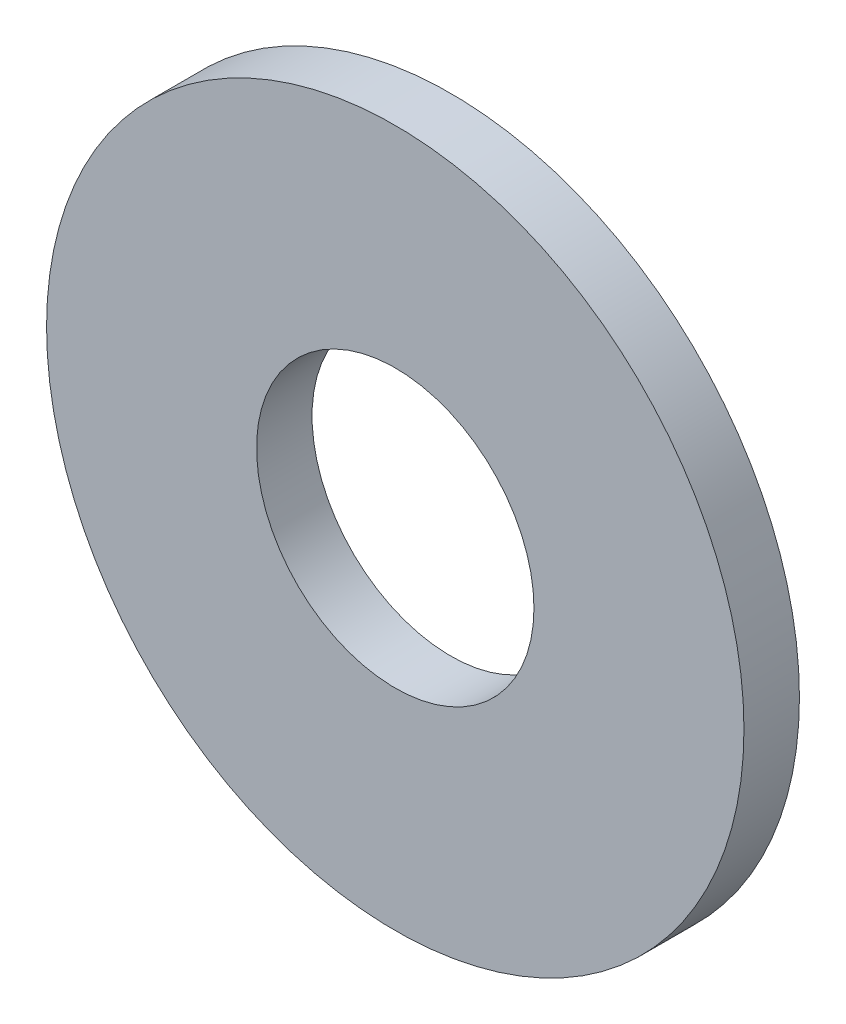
ISO-10303-21;
HEADER;
FILE_DESCRIPTION(('STEP AP214'),'2;1');
FILE_NAME('part.step','',(''),(''),'','','');
FILE_SCHEMA(('AUTOMOTIVE_DESIGN { 1 0 10303 214 1 1 1 1 }'));
ENDSEC;
DATA;
#1=APPLICATION_CONTEXT('core data for automotive mechanical design processes');
#2=APPLICATION_PROTOCOL_DEFINITION('international standard','automotive_design',2000,#1);
#3=PRODUCT_CONTEXT('',#1,'mechanical');
#4=PRODUCT('Part','Part','',(#3));
#5=PRODUCT_RELATED_PRODUCT_CATEGORY('part','',(#4));
#6=PRODUCT_DEFINITION_FORMATION('','',#4);
#7=PRODUCT_DEFINITION_CONTEXT('part definition',#1,'design');
#8=PRODUCT_DEFINITION('design','',#6,#7);
#9=PRODUCT_DEFINITION_SHAPE('','',#8);
#10=(LENGTH_UNIT() NAMED_UNIT(*) SI_UNIT(.MILLI.,.METRE.));
#11=(NAMED_UNIT(*) PLANE_ANGLE_UNIT() SI_UNIT($,.RADIAN.));
#12=(NAMED_UNIT(*) SI_UNIT($,.STERADIAN.) SOLID_ANGLE_UNIT());
#13=UNCERTAINTY_MEASURE_WITH_UNIT(LENGTH_MEASURE(1.E-05),#10,'distance_accuracy_value','');
#14=(GEOMETRIC_REPRESENTATION_CONTEXT(3) GLOBAL_UNCERTAINTY_ASSIGNED_CONTEXT((#13)) GLOBAL_UNIT_ASSIGNED_CONTEXT((#10,
#11,#12)) REPRESENTATION_CONTEXT('',''));
#15=CARTESIAN_POINT('',(0.,0.,0.));
#16=DIRECTION('',(0.,0.,1.));
#17=DIRECTION('',(1.,0.,0.));
#18=AXIS2_PLACEMENT_3D('',#15,#16,#17);
#19=CARTESIAN_POINT('',(0.,0.,0.7));
#20=DIRECTION('',(0.,0.,1.));
#21=DIRECTION('',(1.,0.,0.));
#22=AXIS2_PLACEMENT_3D('',#19,#20,#21);
#23=PLANE('',#22);
#24=CARTESIAN_POINT('',(0.,0.,0.7));
#25=DIRECTION('',(0.,0.,1.));
#26=DIRECTION('',(1.,0.,0.));
#27=AXIS2_PLACEMENT_3D('',#24,#25,#26);
#28=CIRCLE('',#27,4.4);
#29=CARTESIAN_POINT('',(4.4,0.,0.7));
#30=VERTEX_POINT('',#29);
#31=EDGE_CURVE('E10',#30,#30,#28,.T.);
#32=ORIENTED_EDGE('',*,*,#31,.T.);
#33=EDGE_LOOP('',(#32));
#34=FACE_BOUND('',#33,.T.);
#35=CARTESIAN_POINT('',(0.,0.,0.7));
#36=DIRECTION('',(0.,0.,1.));
#37=DIRECTION('',(1.,0.,0.));
#38=AXIS2_PLACEMENT_3D('',#35,#36,#37);
#39=CIRCLE('',#38,1.75);
#40=CARTESIAN_POINT('',(1.75,0.,0.7));
#41=VERTEX_POINT('',#40);
#42=EDGE_CURVE('E359',#41,#41,#39,.T.);
#43=ORIENTED_EDGE('',*,*,#42,.F.);
#44=EDGE_LOOP('',(#43));
#45=FACE_BOUND('',#44,.T.);
#46=ADVANCED_FACE('F348',(#34,#45),#23,.T.);
#47=CARTESIAN_POINT('',(0.,0.,0.));
#48=DIRECTION('',(0.,0.,1.));
#49=DIRECTION('',(1.,0.,0.));
#50=AXIS2_PLACEMENT_3D('',#47,#48,#49);
#51=PLANE('',#50);
#52=CARTESIAN_POINT('',(0.,0.,0.));
#53=DIRECTION('',(0.,0.,1.));
#54=DIRECTION('',(1.,0.,0.));
#55=AXIS2_PLACEMENT_3D('',#52,#53,#54);
#56=CIRCLE('',#55,4.4);
#57=CARTESIAN_POINT('',(4.4,0.,0.));
#58=VERTEX_POINT('',#57);
#59=EDGE_CURVE('E355',#58,#58,#56,.T.);
#60=ORIENTED_EDGE('',*,*,#59,.F.);
#61=EDGE_LOOP('',(#60));
#62=FACE_BOUND('',#61,.T.);
#63=CARTESIAN_POINT('',(0.,0.,0.));
#64=DIRECTION('',(0.,0.,1.));
#65=DIRECTION('',(1.,0.,0.));
#66=AXIS2_PLACEMENT_3D('',#63,#64,#65);
#67=CIRCLE('',#66,1.75);
#68=CARTESIAN_POINT('',(1.75,0.,0.));
#69=VERTEX_POINT('',#68);
#70=EDGE_CURVE('E363',#69,#69,#67,.T.);
#71=ORIENTED_EDGE('',*,*,#70,.T.);
#72=EDGE_LOOP('',(#71));
#73=FACE_BOUND('',#72,.T.);
#74=ADVANCED_FACE('F369',(#62,#73),#51,.F.);
#75=CARTESIAN_POINT('',(0.,0.,0.7));
#76=DIRECTION('',(0.,0.,-1.));
#77=DIRECTION('',(-1.,0.,0.));
#78=AXIS2_PLACEMENT_3D('',#75,#76,#77);
#79=CYLINDRICAL_SURFACE('',#78,4.4);
#80=ORIENTED_EDGE('',*,*,#31,.F.);
#81=EDGE_LOOP('',(#80));
#82=FACE_BOUND('',#81,.T.);
#83=ORIENTED_EDGE('',*,*,#59,.T.);
#84=EDGE_LOOP('',(#83));
#85=FACE_BOUND('',#84,.T.);
#86=ADVANCED_FACE('F350',(#82,#85),#79,.T.);
#87=CARTESIAN_POINT('',(0.,0.,0.7));
#88=DIRECTION('',(0.,0.,-1.));
#89=DIRECTION('',(-1.,0.,0.));
#90=AXIS2_PLACEMENT_3D('',#87,#88,#89);
#91=CYLINDRICAL_SURFACE('',#90,1.75);
#92=ORIENTED_EDGE('',*,*,#42,.T.);
#93=EDGE_LOOP('',(#92));
#94=FACE_BOUND('',#93,.T.);
#95=ORIENTED_EDGE('',*,*,#70,.F.);
#96=EDGE_LOOP('',(#95));
#97=FACE_BOUND('',#96,.T.);
#98=ADVANCED_FACE('F371',(#94,#97),#91,.F.);
#99=CLOSED_SHELL('',(#46,#74,#86,#98));
#100=MANIFOLD_SOLID_BREP('B2',#99);
#101=ADVANCED_BREP_SHAPE_REPRESENTATION('',(#18,#100),#14);
#102=SHAPE_DEFINITION_REPRESENTATION(#9,#101);
ENDSEC;
END-ISO-10303-21;
